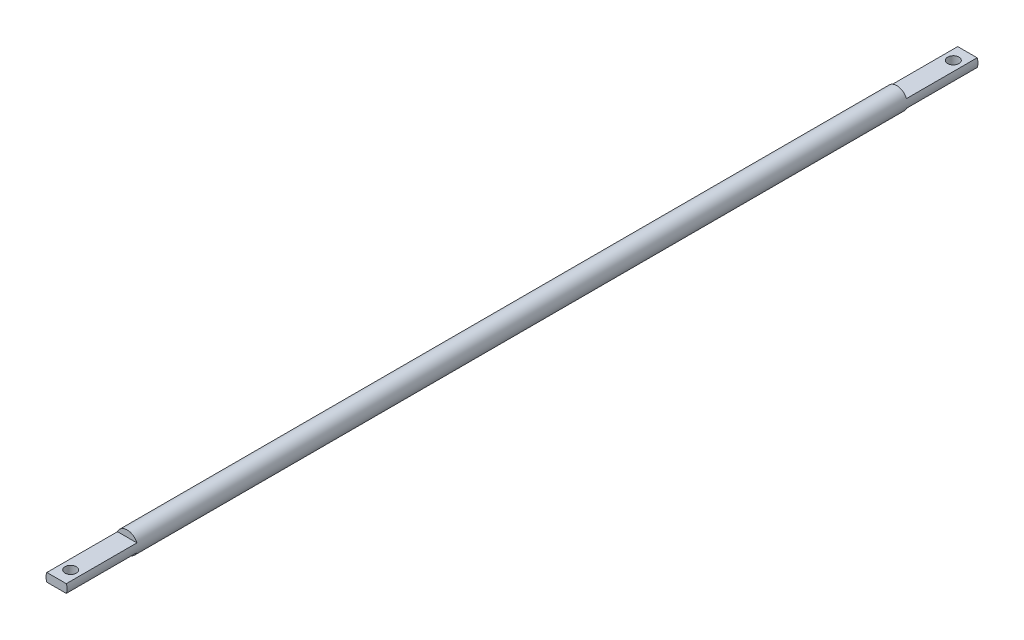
from build123d import *

# Parameters (mm, degrees)
ESQUISSE1_R             = 7.5
BASE_EXTRUSION_DEPTH    = 322.5
ESQUISSE2_W             = 16.264481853
ESQUISSE2_H             = 4.717403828
ENL_V_MAT_EXTRU_1_DEPTH = 50
ESQUISSE5_W             = 16.826423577
ESQUISSE5_H             = 5.800026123
ESQUISSE5_W_2           = 17.379015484
ESQUISSE5_H_2           = 6.907398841
ENL_V_MAT_EXTRU_4_DEPTH = 50
ESQUISSE6_R             = 4
ENL_V_MAT_EXTRU_5_DEPTH = 323.758036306
ESQUISSE7_R             = 4
ENL_V_MAT_EXTRU_6_DEPTH = 323.758036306


with BuildPart() as part:
    # Esquisse1 → Base-Extrusion (new, symmetric)
    with BuildSketch(Plane.XY):
        with Locations(Location((0, 0, 0), (0, 0, 180))):
            Circle(ESQUISSE1_R)
    extrude(amount=BASE_EXTRUSION_DEPTH, both=True)

    # Esquisse2 → Enl_v. mat.-Extru.1 (cut)
    with BuildSketch(Plane.XY.offset(322.5)):
        with Locations((-0.28163605, 5.358701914)):
            Rectangle(ESQUISSE2_W, ESQUISSE2_H)
        with Locations((-0.28163605, -5.358701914)):
            Rectangle(ESQUISSE2_W, ESQUISSE2_H)
    extrude(amount=-ENL_V_MAT_EXTRU_1_DEPTH, mode=Mode.SUBTRACT)

    # Esquisse5 → Enl_v. mat.-Extru.4 (cut)
    with BuildSketch(Plane(origin=(0, 0, -322.5), x_dir=(-1, 0, 0), z_dir=(0, 0, -1))):
        with Locations((0.114569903, 5.900013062)):
            Rectangle(ESQUISSE5_W, ESQUISSE5_H)
        with Locations((0.390865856, -6.453699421)):
            Rectangle(ESQUISSE5_W_2, ESQUISSE5_H_2)
    extrude(amount=-ENL_V_MAT_EXTRU_4_DEPTH, mode=Mode.SUBTRACT)

    # Esquisse6 → Enl_v. mat.-Extru.5 (cut, through all)
    with BuildSketch(Plane.XZ.offset(3)):
        with Locations(Location((0, 312.5, 0), (0, 0, 270))):
            Circle(ESQUISSE6_R)
    extrude(amount=-ENL_V_MAT_EXTRU_5_DEPTH, mode=Mode.SUBTRACT)

    # Esquisse7 → Enl_v. mat.-Extru.6 (cut, through all)
    with BuildSketch(Plane(origin=(0, -3, 0), x_dir=(-1, 0, 0), z_dir=(0, 1, 0))):
        with Locations(Location((0, -312.5, 0), (0, 0, 270))):
            Circle(ESQUISSE7_R)
    extrude(amount=ENL_V_MAT_EXTRU_6_DEPTH, mode=Mode.SUBTRACT)


solid = part.part
